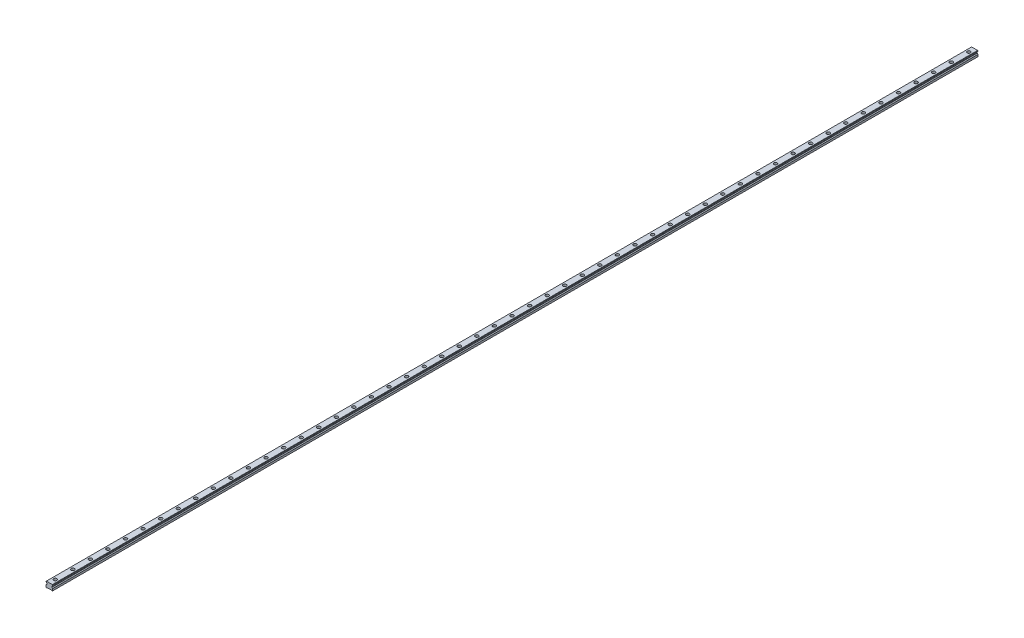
from build123d import *

# Parameters (mm, degrees)
SKETCH1_W           = 23
SKETCH1_H           = 19.2
BOSS_EXTRUDE1_DEPTH = 1580
CUT_EXTRUDE1_DEPTH  = 3161.079253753
CHAMFER1_SIZE       = 1.25
FILLET1_R           = 1.25
CUT_EXTRUDE2_DEPTH  = 3161.079253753
SKETCH4_R           = 5.5
SKETCH4_R_2         = 3.5
CUT_EXTRUDE3_DEPTH  = 9
SKETCH4_2_R         = 3.5
CUT_EXTRUDE4_DEPTH  = 1581.158501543
LPATTERN1_COUNT     = 53
LPATTERN1_PITCH     = 60


with BuildPart() as part:
    # Sketch1 → Boss-Extrude1 (new, symmetric)
    with BuildSketch(Plane.XY):
        with Locations((0, 9.6)):
            Rectangle(SKETCH1_W, SKETCH1_H)
    extrude(amount=BOSS_EXTRUDE1_DEPTH, both=True)

    # Sketch2 → Cut-Extrude1 (cut, through all)
    with BuildSketch(Plane.XY.offset(1580)):
        Polygon((-11.5, 16.7), (-11.5, 7.95), (-8.583333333, 10.866666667), (-8.583333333, 13.783333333), align=None)
        Polygon((8.583333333, 13.783333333), (11.5, 16.7), (11.5, 7.95), (8.583333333, 10.866666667), align=None)
    extrude(amount=-CUT_EXTRUDE1_DEPTH, mode=Mode.SUBTRACT)

    # Chamfer1
    chamfer1_edges = [part.edges().sort_by_distance(p)[0] for p in [
        (-11.5, 19.2, 0),
        (11.5, 19.2, 0),
        (11.5, 0, 0),
        (-11.5, 0, 0),
    ]]
    chamfer(chamfer1_edges, length=CHAMFER1_SIZE)

    # Fillet1
    fillet1_edges = [part.edges().sort_by_distance(p)[0] for p in [
        (-8.583333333, 13.783333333, 0),
        (-8.583333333, 10.866666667, 0),
        (8.583333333, 10.866666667, 0),
        (8.583333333, 13.783333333, 0),
    ]]
    fillet(fillet1_edges, radius=FILLET1_R)

    # Sketch3 → Cut-Extrude2 (cut, through all)
    with BuildSketch(Plane.XY.offset(1580)):
        Polygon((-7, 0), (-5.75, 1.25), (5.75, 1.25), (7, 0), align=None)
    extrude(amount=-CUT_EXTRUDE2_DEPTH, mode=Mode.SUBTRACT)

    # Sketch4 → Cut-Extrude3 (cut)
    with BuildSketch(Plane(origin=(0, 19.2, 0), x_dir=(1, 0, 0), z_dir=(0, 1, 0))):
        with Locations(Location((0, -1560, 0), (0, 0, 270))):
            Circle(SKETCH4_R)
        with Locations(Location((0, -1560, 0), (0, 0, 270))):
            Circle(SKETCH4_R_2, mode=Mode.SUBTRACT)
    cut_extrude3 = extrude(amount=-CUT_EXTRUDE3_DEPTH, mode=Mode.SUBTRACT)

    # Sketch4_2 → Cut-Extrude4 (cut, through all)
    with BuildSketch(Plane(origin=(0, 19.2, 0), x_dir=(1, 0, 0), z_dir=(0, 1, 0))):
        with Locations(Location((0, -1560, 0), (0, 0, 270))):
            Circle(SKETCH4_2_R)
    cut_extrude4 = extrude(amount=-CUT_EXTRUDE4_DEPTH, mode=Mode.SUBTRACT)

    # LPattern1: Cut-Extrude3, Cut-Extrude4 ×53
    with Locations(*[(0, 0, -i * LPATTERN1_PITCH) for i in range(1, LPATTERN1_COUNT)]):
        add(cut_extrude3, mode=Mode.SUBTRACT)
        add(cut_extrude4, mode=Mode.SUBTRACT)


solid = part.part
